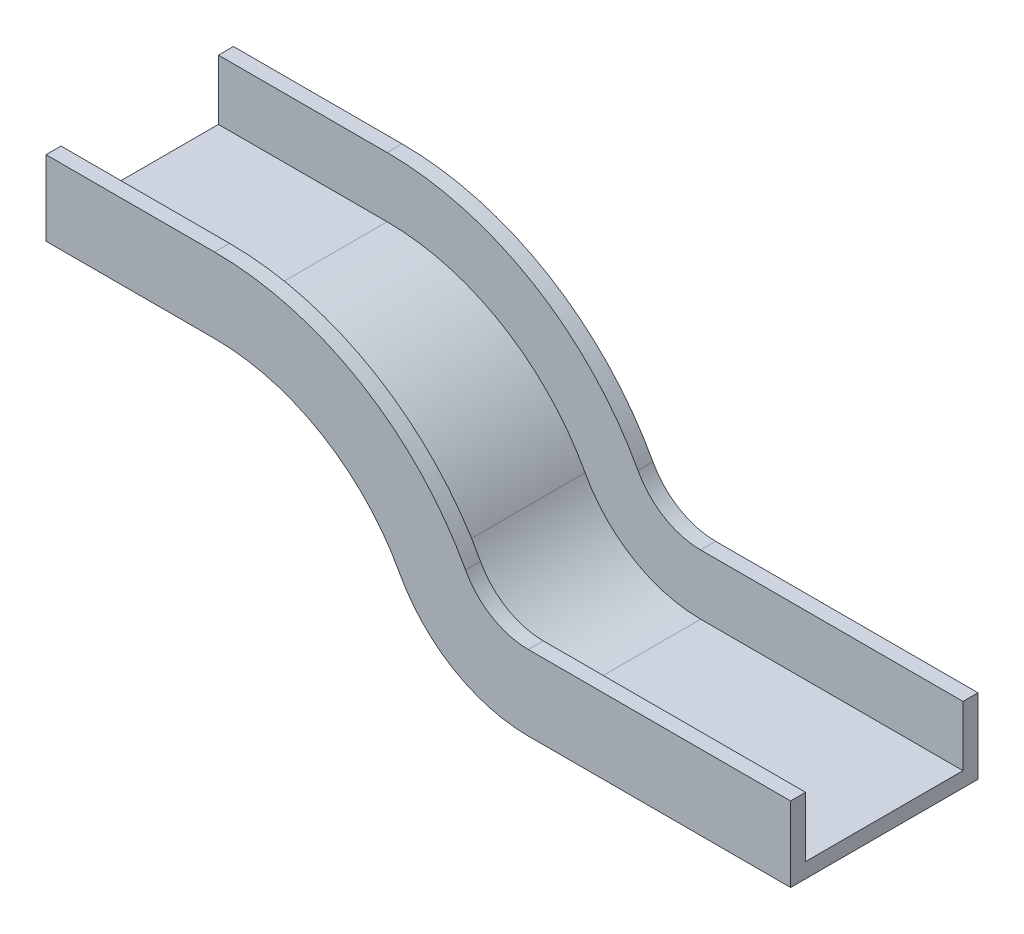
from build123d import *


with BuildPart() as part:
    # Sweep1: sweep along a path in Sketch1
    with BuildLine(Plane.XY) as sweep1_path:
        Line((0, 0), (45, 0))
        ThreePointArc((45, 0), (75.779350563, -8.496295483), (97.841685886, -31.578947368))
        ThreePointArc((97.841685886, -31.578947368), (110.711381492, -45.043827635), (128.666002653, -50))
        Line((128.666002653, -50), (198.666002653, -50))
    # Sketch2 → Sweep1 (sweep)
    with BuildSketch(Plane(origin=(0, 0, 0), x_dir=(0, 0, -1), z_dir=(1, 0, 0))):
        Polygon((21, 0), (-21, 0), (-21, 16), (-25, 16), (-25, -4), (25, -4), (25, 16), (21, 16), align=None)
    sweep(path=sweep1_path.line)


solid = part.part
